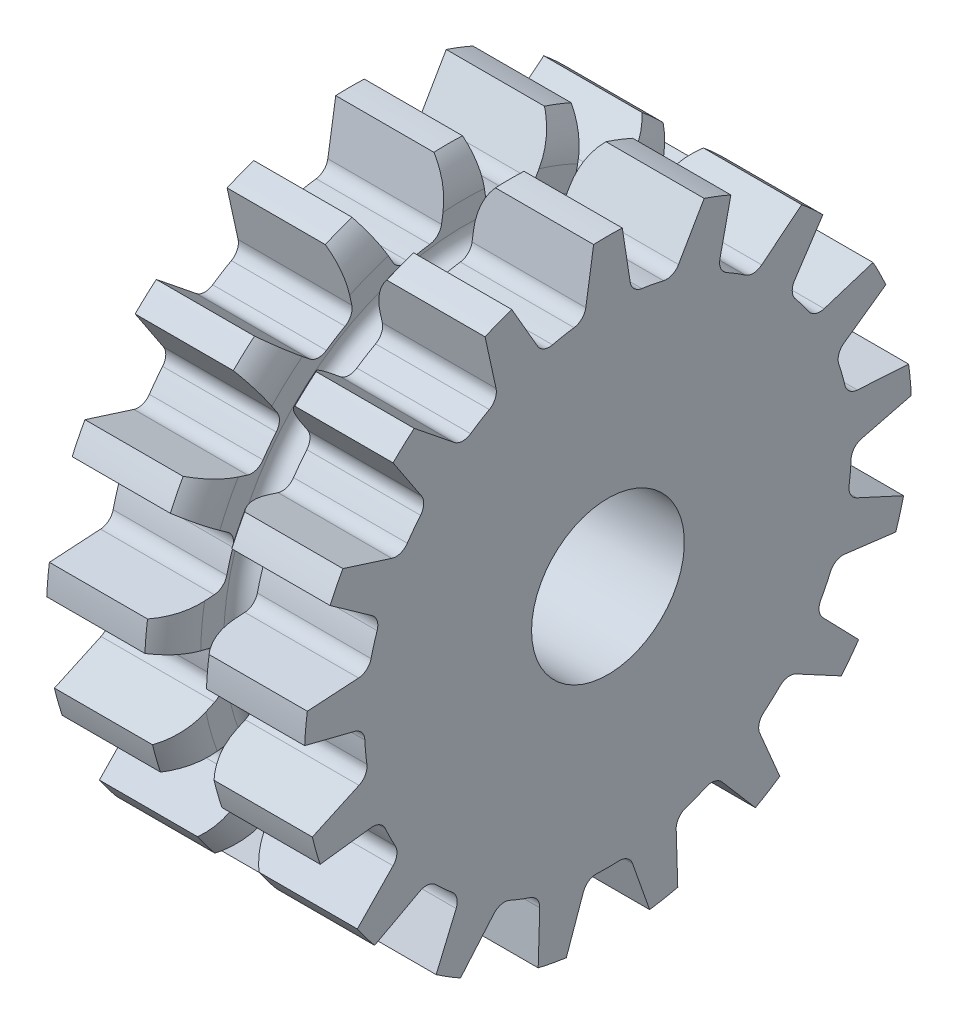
from build123d import *

# Parameters (mm, degrees)
BASPROSKE_W           = 21.4376
BASPROSKE_H           = 25.231725
TOOTHCUTSQUARE_DEPTH  = 42.627521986
TEETHCUTSSQUARE_COUNT = 17
TEETHCUTSSQUARE_ANGLE = 338.823529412
BORSKE_R              = 6.35
BORE_DEPTH            = 76.2000508


with BuildPart() as part:
    # BasProSke → Body (revolve)
    with BuildSketch(Plane(origin=(0, 0, 0), x_dir=(1, 0, 0), z_dir=(0, 1, 0)), mode=Mode.PRIVATE) as body_sk:
        with Locations((10.7188, 12.6158625)):
            Rectangle(BASPROSKE_W, BASPROSKE_H)
    revolve(body_sk.sketch.rotate(Axis((-10, 0, 0), (1, 0, 0)), 180), axis=Axis((-10, 0, 0), (1, 0, 0)))

    # TooCutSqSke → ToothCutSquare (cut, through all)
    with BuildSketch(Plane(origin=(0, 0, 0), x_dir=(0, 0, -1), z_dir=(1, 0, 0))):
        with BuildLine():
            Line((-5.862352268, 20.238374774), (-8.31855065, 24.492635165))
            ThreePointArc((-8.31855065, 24.492635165), (-4.752998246, 25.426294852), (-1.090942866, 25.843709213))
            Line((-1.090942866, 25.843709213), (-1.844463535, 20.989448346))
            ThreePointArc((-1.844463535, 20.989448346), (-2.171553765, 20.350753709), (-2.814892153, 20.032894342))
            ThreePointArc((-2.814892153, 20.032894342), (-3.71719631, 19.885243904), (-4.611907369, 19.69697398))
            ThreePointArc((-4.611907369, 19.69697398), (-5.326626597, 19.760968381), (-5.862352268, 20.238374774))
        make_face()
    toothcutsquare = extrude(amount=TOOTHCUTSQUARE_DEPTH, mode=Mode.SUBTRACT)

    # TeethCutsSquare: ToothCutSquare ×17 about axis
    teethcutssquare_axis = Axis((-10, 0, 0), (1, 0, 0))
    for i in range(1, TEETHCUTSSQUARE_COUNT):
        add(toothcutsquare.rotate(teethcutssquare_axis, i * TEETHCUTSSQUARE_ANGLE / (TEETHCUTSSQUARE_COUNT - 1)), mode=Mode.SUBTRACT)

    # GrvSke → Groove (revolve, cut)
    with BuildSketch(Plane(origin=(0, 0, 0), x_dir=(1, 0, 0), z_dir=(0, 1, 0)), mode=Mode.PRIVATE) as groove_sk:
        with BuildLine():
            Line((11.98626, 21.853525), (11.98626, 19.9501125))
            ThreePointArc((11.98626, 19.9501125), (10.71626, 18.6801125), (9.44626, 19.9501125))
            Line((9.44626, 19.9501125), (9.44626, 21.853525))
            ThreePointArc((9.44626, 21.853525), (8.621732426, 24.627935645), (6.415805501, 26.501725))
            Line((6.415805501, 26.501725), (15.016714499, 26.501725))
            ThreePointArc((15.016714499, 26.501725), (12.810787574, 24.627935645), (11.98626, 21.853525))
        make_face()
    revolve(groove_sk.sketch.rotate(Axis((-14.834179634, 0, 0), (1, 0, 0)), 180), axis=Axis((-14.834179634, 0, 0), (1, 0, 0)), mode=Mode.SUBTRACT)

    # BorSke → Bore (cut, symmetric)
    with BuildSketch(Plane(origin=(0, 0, 0), x_dir=(0, 0, -1), z_dir=(1, 0, 0))):
        with Locations(Location((0, 0, 0), (0, 0, 180))):
            Circle(BORSKE_R)
    extrude(amount=BORE_DEPTH, both=True, mode=Mode.SUBTRACT)


solid = part.part
